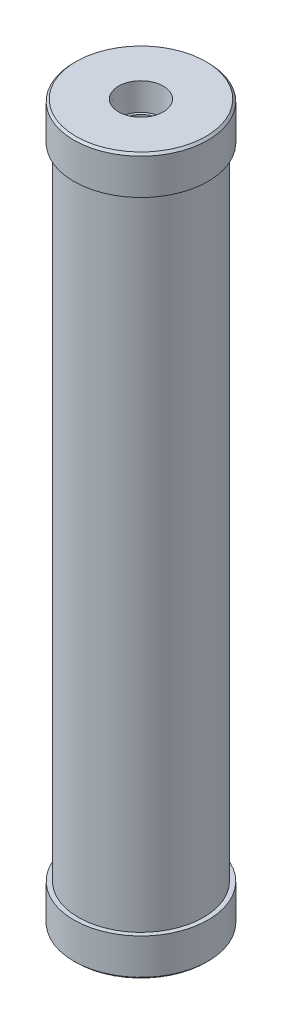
ISO-10303-21;
HEADER;
FILE_DESCRIPTION(('STEP AP214'),'2;1');
FILE_NAME('part.step','',(''),(''),'','','');
FILE_SCHEMA(('AUTOMOTIVE_DESIGN { 1 0 10303 214 1 1 1 1 }'));
ENDSEC;
DATA;
#1=APPLICATION_CONTEXT('core data for automotive mechanical design processes');
#2=APPLICATION_PROTOCOL_DEFINITION('international standard','automotive_design',2000,#1);
#3=PRODUCT_CONTEXT('',#1,'mechanical');
#4=PRODUCT('Part','Part','',(#3));
#5=PRODUCT_RELATED_PRODUCT_CATEGORY('part','',(#4));
#6=PRODUCT_DEFINITION_FORMATION('','',#4);
#7=PRODUCT_DEFINITION_CONTEXT('part definition',#1,'design');
#8=PRODUCT_DEFINITION('design','',#6,#7);
#9=PRODUCT_DEFINITION_SHAPE('','',#8);
#10=(LENGTH_UNIT() NAMED_UNIT(*) SI_UNIT(.MILLI.,.METRE.));
#11=(NAMED_UNIT(*) PLANE_ANGLE_UNIT() SI_UNIT($,.RADIAN.));
#12=(NAMED_UNIT(*) SI_UNIT($,.STERADIAN.) SOLID_ANGLE_UNIT());
#13=UNCERTAINTY_MEASURE_WITH_UNIT(LENGTH_MEASURE(1.E-05),#10,'distance_accuracy_value','');
#14=(GEOMETRIC_REPRESENTATION_CONTEXT(3) GLOBAL_UNCERTAINTY_ASSIGNED_CONTEXT((#13)) GLOBAL_UNIT_ASSIGNED_CONTEXT((#10,
#11,#12)) REPRESENTATION_CONTEXT('',''));
#15=CARTESIAN_POINT('',(0.,0.,0.));
#16=DIRECTION('',(0.,0.,1.));
#17=DIRECTION('',(1.,0.,0.));
#18=AXIS2_PLACEMENT_3D('',#15,#16,#17);
#19=CARTESIAN_POINT('',(0.,508.,0.));
#20=DIRECTION('',(0.,-1.,0.));
#21=DIRECTION('',(0.,0.,-1.));
#22=AXIS2_PLACEMENT_3D('',#19,#20,#21);
#23=CYLINDRICAL_SURFACE('',#22,44.45);
#24=CARTESIAN_POINT('',(0.,26.924,0.));
#25=DIRECTION('',(0.,1.,0.));
#26=DIRECTION('',(0.,0.,1.));
#27=AXIS2_PLACEMENT_3D('',#24,#25,#26);
#28=CIRCLE('',#27,44.45);
#29=CARTESIAN_POINT('',(0.,26.924,44.45));
#30=VERTEX_POINT('',#29);
#31=EDGE_CURVE('E71',#30,#30,#28,.T.);
#32=ORIENTED_EDGE('',*,*,#31,.T.);
#33=EDGE_LOOP('',(#32));
#34=FACE_BOUND('',#33,.T.);
#35=CARTESIAN_POINT('',(0.,481.076,0.));
#36=DIRECTION('',(0.,1.,0.));
#37=DIRECTION('',(0.,0.,1.));
#38=AXIS2_PLACEMENT_3D('',#35,#36,#37);
#39=CIRCLE('',#38,44.45);
#40=CARTESIAN_POINT('',(0.,481.076,44.45));
#41=VERTEX_POINT('',#40);
#42=EDGE_CURVE('E53',#41,#41,#39,.T.);
#43=ORIENTED_EDGE('',*,*,#42,.F.);
#44=EDGE_LOOP('',(#43));
#45=FACE_BOUND('',#44,.T.);
#46=ADVANCED_FACE('F33',(#34,#45),#23,.T.);
#47=CARTESIAN_POINT('',(0.,508.,0.));
#48=DIRECTION('',(0.,-1.,0.));
#49=DIRECTION('',(0.,0.,-1.));
#50=AXIS2_PLACEMENT_3D('',#47,#48,#49);
#51=CYLINDRICAL_SURFACE('',#50,38.6334);
#52=CARTESIAN_POINT('',(0.,26.924,0.));
#53=DIRECTION('',(0.,1.,0.));
#54=DIRECTION('',(0.,0.,1.));
#55=AXIS2_PLACEMENT_3D('',#52,#53,#54);
#56=CIRCLE('',#55,38.6334);
#57=CARTESIAN_POINT('',(0.,26.924,38.6334));
#58=VERTEX_POINT('',#57);
#59=EDGE_CURVE('E68',#58,#58,#56,.T.);
#60=ORIENTED_EDGE('',*,*,#59,.F.);
#61=EDGE_LOOP('',(#60));
#62=FACE_BOUND('',#61,.T.);
#63=CARTESIAN_POINT('',(0.,481.076,0.));
#64=DIRECTION('',(0.,1.,0.));
#65=DIRECTION('',(0.,0.,1.));
#66=AXIS2_PLACEMENT_3D('',#63,#64,#65);
#67=CIRCLE('',#66,38.6334);
#68=CARTESIAN_POINT('',(0.,481.076,38.6334));
#69=VERTEX_POINT('',#68);
#70=EDGE_CURVE('E59',#69,#69,#67,.T.);
#71=ORIENTED_EDGE('',*,*,#70,.T.);
#72=EDGE_LOOP('',(#71));
#73=FACE_BOUND('',#72,.T.);
#74=ADVANCED_FACE('F115',(#62,#73),#51,.F.);
#75=CARTESIAN_POINT('',(0.,26.924,0.));
#76=DIRECTION('',(0.,1.,0.));
#77=DIRECTION('',(0.,0.,1.));
#78=AXIS2_PLACEMENT_3D('',#75,#76,#77);
#79=PLANE('',#78);
#80=CARTESIAN_POINT('',(0.,26.924,0.));
#81=DIRECTION('',(0.,1.,0.));
#82=DIRECTION('',(0.,0.,1.));
#83=AXIS2_PLACEMENT_3D('',#80,#81,#82);
#84=CIRCLE('',#83,13.5);
#85=CARTESIAN_POINT('',(0.,26.924,13.5));
#86=VERTEX_POINT('',#85);
#87=EDGE_CURVE('E63',#86,#86,#84,.T.);
#88=ORIENTED_EDGE('',*,*,#87,.F.);
#89=EDGE_LOOP('',(#88));
#90=FACE_BOUND('',#89,.T.);
#91=ORIENTED_EDGE('',*,*,#59,.T.);
#92=EDGE_LOOP('',(#91));
#93=FACE_BOUND('',#92,.T.);
#94=ADVANCED_FACE('F121',(#90,#93),#79,.T.);
#95=CARTESIAN_POINT('',(0.,26.924,0.));
#96=DIRECTION('',(0.,1.,0.));
#97=DIRECTION('',(0.,0.,1.));
#98=AXIS2_PLACEMENT_3D('',#95,#96,#97);
#99=CIRCLE('',#98,47.625);
#100=CARTESIAN_POINT('',(0.,26.924,47.625));
#101=VERTEX_POINT('',#100);
#102=EDGE_CURVE('E66',#101,#101,#99,.T.);
#103=ORIENTED_EDGE('',*,*,#102,.T.);
#104=EDGE_LOOP('',(#103));
#105=FACE_BOUND('',#104,.T.);
#106=ORIENTED_EDGE('',*,*,#31,.F.);
#107=EDGE_LOOP('',(#106));
#108=FACE_BOUND('',#107,.T.);
#109=ADVANCED_FACE('F142',(#105,#108),#79,.T.);
#110=CARTESIAN_POINT('',(0.,26.924,0.));
#111=DIRECTION('',(0.,-1.,0.));
#112=DIRECTION('',(0.,0.,-1.));
#113=AXIS2_PLACEMENT_3D('',#110,#111,#112);
#114=CYLINDRICAL_SURFACE('',#113,47.625);
#115=CARTESIAN_POINT('',(0.,1.52400000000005,0.));
#116=DIRECTION('',(0.,1.,0.));
#117=DIRECTION('',(0.,0.,1.));
#118=AXIS2_PLACEMENT_3D('',#115,#116,#117);
#119=CIRCLE('',#118,47.625);
#120=CARTESIAN_POINT('',(0.,1.52400000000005,47.625));
#121=VERTEX_POINT('',#120);
#122=EDGE_CURVE('E48',#121,#121,#119,.T.);
#123=ORIENTED_EDGE('',*,*,#122,.T.);
#124=EDGE_LOOP('',(#123));
#125=FACE_BOUND('',#124,.T.);
#126=ORIENTED_EDGE('',*,*,#102,.F.);
#127=EDGE_LOOP('',(#126));
#128=FACE_BOUND('',#127,.T.);
#129=ADVANCED_FACE('F139',(#125,#128),#114,.T.);
#130=CARTESIAN_POINT('',(0.,0.,0.));
#131=DIRECTION('',(0.,1.,0.));
#132=DIRECTION('',(0.,0.,1.));
#133=AXIS2_PLACEMENT_3D('',#130,#131,#132);
#134=PLANE('',#133);
#135=CARTESIAN_POINT('',(0.,0.,0.));
#136=DIRECTION('',(0.,1.,0.));
#137=DIRECTION('',(0.,0.,1.));
#138=AXIS2_PLACEMENT_3D('',#135,#136,#137);
#139=CIRCLE('',#138,46.1009999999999);
#140=CARTESIAN_POINT('',(0.,0.,46.1009999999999));
#141=VERTEX_POINT('',#140);
#142=EDGE_CURVE('E44',#141,#141,#139,.F.);
#143=ORIENTED_EDGE('',*,*,#142,.T.);
#144=EDGE_LOOP('',(#143));
#145=FACE_BOUND('',#144,.T.);
#146=CARTESIAN_POINT('',(0.,0.,0.));
#147=DIRECTION('',(0.,-1.,0.));
#148=DIRECTION('',(0.,0.,-1.));
#149=AXIS2_PLACEMENT_3D('',#146,#147,#148);
#150=CIRCLE('',#149,15.886561);
#151=CARTESIAN_POINT('',(0.,0.,-15.886561));
#152=VERTEX_POINT('',#151);
#153=EDGE_CURVE('E62',#152,#152,#150,.T.);
#154=ORIENTED_EDGE('',*,*,#153,.F.);
#155=EDGE_LOOP('',(#154));
#156=FACE_BOUND('',#155,.T.);
#157=ADVANCED_FACE('F124',(#145,#156),#134,.F.);
#158=CARTESIAN_POINT('',(0.,0.,0.));
#159=DIRECTION('',(0.,-1.,0.));
#160=DIRECTION('',(0.,0.,-1.));
#161=AXIS2_PLACEMENT_3D('',#158,#159,#160);
#162=CYLINDRICAL_SURFACE('',#161,13.5);
#163=ORIENTED_EDGE('',*,*,#87,.T.);
#164=EDGE_LOOP('',(#163));
#165=FACE_BOUND('',#164,.T.);
#166=CARTESIAN_POINT('',(0.,19.05,0.));
#167=DIRECTION('',(0.,-1.,0.));
#168=DIRECTION('',(0.,0.,-1.));
#169=AXIS2_PLACEMENT_3D('',#166,#167,#168);
#170=CIRCLE('',#169,13.5);
#171=CARTESIAN_POINT('',(0.,19.05,-13.5));
#172=VERTEX_POINT('',#171);
#173=EDGE_CURVE('E67',#172,#172,#170,.T.);
#174=ORIENTED_EDGE('',*,*,#173,.T.);
#175=EDGE_LOOP('',(#174));
#176=FACE_BOUND('',#175,.T.);
#177=ADVANCED_FACE('F155',(#165,#176),#162,.F.);
#178=CARTESIAN_POINT('',(13.5,19.05,0.));
#179=DIRECTION('',(0.,1.,0.));
#180=DIRECTION('',(0.,0.,1.));
#181=AXIS2_PLACEMENT_3D('',#178,#179,#180);
#182=PLANE('',#181);
#183=ORIENTED_EDGE('',*,*,#173,.F.);
#184=EDGE_LOOP('',(#183));
#185=FACE_BOUND('',#184,.T.);
#186=CARTESIAN_POINT('',(0.,19.05,0.));
#187=DIRECTION('',(0.,-1.,0.));
#188=DIRECTION('',(0.,0.,-1.));
#189=AXIS2_PLACEMENT_3D('',#186,#187,#188);
#190=CIRCLE('',#189,15.2918843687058);
#191=CARTESIAN_POINT('',(0.,19.05,-15.2918843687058));
#192=VERTEX_POINT('',#191);
#193=EDGE_CURVE('E78',#192,#192,#190,.T.);
#194=ORIENTED_EDGE('',*,*,#193,.T.);
#195=EDGE_LOOP('',(#194));
#196=FACE_BOUND('',#195,.T.);
#197=ADVANCED_FACE('F158',(#185,#196),#182,.F.);
#198=CARTESIAN_POINT('',(0.,0.,0.));
#199=DIRECTION('',(0.,-1.,0.));
#200=DIRECTION('',(0.,0.,-1.));
#201=AXIS2_PLACEMENT_3D('',#198,#199,#200);
#202=CONICAL_SURFACE('',#201,15.886561,0.0312064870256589);
#203=ORIENTED_EDGE('',*,*,#193,.F.);
#204=EDGE_LOOP('',(#203));
#205=FACE_BOUND('',#204,.T.);
#206=ORIENTED_EDGE('',*,*,#153,.T.);
#207=EDGE_LOOP('',(#206));
#208=FACE_BOUND('',#207,.T.);
#209=ADVANCED_FACE('F162',(#205,#208),#202,.F.);
#210=CARTESIAN_POINT('',(0.,481.076,0.));
#211=DIRECTION('',(0.,1.,0.));
#212=DIRECTION('',(0.,0.,1.));
#213=AXIS2_PLACEMENT_3D('',#210,#211,#212);
#214=PLANE('',#213);
#215=CARTESIAN_POINT('',(0.,481.076,0.));
#216=DIRECTION('',(0.,1.,0.));
#217=DIRECTION('',(0.,0.,1.));
#218=AXIS2_PLACEMENT_3D('',#215,#216,#217);
#219=CIRCLE('',#218,13.5);
#220=CARTESIAN_POINT('',(0.,481.076,13.5));
#221=VERTEX_POINT('',#220);
#222=EDGE_CURVE('E54',#221,#221,#219,.T.);
#223=ORIENTED_EDGE('',*,*,#222,.T.);
#224=EDGE_LOOP('',(#223));
#225=FACE_BOUND('',#224,.T.);
#226=ORIENTED_EDGE('',*,*,#70,.F.);
#227=EDGE_LOOP('',(#226));
#228=FACE_BOUND('',#227,.T.);
#229=ADVANCED_FACE('F165',(#225,#228),#214,.F.);
#230=CARTESIAN_POINT('',(0.,481.076,0.));
#231=DIRECTION('',(0.,1.,0.));
#232=DIRECTION('',(0.,0.,1.));
#233=AXIS2_PLACEMENT_3D('',#230,#231,#232);
#234=CIRCLE('',#233,47.625);
#235=CARTESIAN_POINT('',(0.,481.076,47.625));
#236=VERTEX_POINT('',#235);
#237=EDGE_CURVE('E57',#236,#236,#234,.T.);
#238=ORIENTED_EDGE('',*,*,#237,.F.);
#239=EDGE_LOOP('',(#238));
#240=FACE_BOUND('',#239,.T.);
#241=ORIENTED_EDGE('',*,*,#42,.T.);
#242=EDGE_LOOP('',(#241));
#243=FACE_BOUND('',#242,.T.);
#244=ADVANCED_FACE('F110',(#240,#243),#214,.F.);
#245=CARTESIAN_POINT('',(0.,481.076,0.));
#246=DIRECTION('',(0.,1.,0.));
#247=DIRECTION('',(0.,0.,1.));
#248=AXIS2_PLACEMENT_3D('',#245,#246,#247);
#249=CYLINDRICAL_SURFACE('',#248,47.625);
#250=CARTESIAN_POINT('',(0.,506.476,0.));
#251=DIRECTION('',(0.,1.,0.));
#252=DIRECTION('',(0.,0.,1.));
#253=AXIS2_PLACEMENT_3D('',#250,#251,#252);
#254=CIRCLE('',#253,47.625);
#255=CARTESIAN_POINT('',(0.,506.476,47.625));
#256=VERTEX_POINT('',#255);
#257=EDGE_CURVE('E10',#256,#256,#254,.F.);
#258=ORIENTED_EDGE('',*,*,#257,.T.);
#259=EDGE_LOOP('',(#258));
#260=FACE_BOUND('',#259,.T.);
#261=ORIENTED_EDGE('',*,*,#237,.T.);
#262=EDGE_LOOP('',(#261));
#263=FACE_BOUND('',#262,.T.);
#264=ADVANCED_FACE('F101',(#260,#263),#249,.T.);
#265=CARTESIAN_POINT('',(0.,508.,0.));
#266=DIRECTION('',(0.,1.,0.));
#267=DIRECTION('',(0.,0.,1.));
#268=AXIS2_PLACEMENT_3D('',#265,#266,#267);
#269=PLANE('',#268);
#270=CARTESIAN_POINT('',(0.,508.,0.));
#271=DIRECTION('',(0.,1.,0.));
#272=DIRECTION('',(0.,0.,1.));
#273=AXIS2_PLACEMENT_3D('',#270,#271,#272);
#274=CIRCLE('',#273,46.1010000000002);
#275=CARTESIAN_POINT('',(0.,508.,46.1010000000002));
#276=VERTEX_POINT('',#275);
#277=EDGE_CURVE('E40',#276,#276,#274,.T.);
#278=ORIENTED_EDGE('',*,*,#277,.T.);
#279=EDGE_LOOP('',(#278));
#280=FACE_BOUND('',#279,.T.);
#281=CARTESIAN_POINT('',(0.,508.,0.));
#282=DIRECTION('',(0.,1.,0.));
#283=DIRECTION('',(0.,0.,1.));
#284=AXIS2_PLACEMENT_3D('',#281,#282,#283);
#285=CIRCLE('',#284,15.886561);
#286=CARTESIAN_POINT('',(0.,508.,15.886561));
#287=VERTEX_POINT('',#286);
#288=EDGE_CURVE('E92',#287,#287,#285,.T.);
#289=ORIENTED_EDGE('',*,*,#288,.F.);
#290=EDGE_LOOP('',(#289));
#291=FACE_BOUND('',#290,.T.);
#292=ADVANCED_FACE('F98',(#280,#291),#269,.T.);
#293=CARTESIAN_POINT('',(0.,508.,0.));
#294=DIRECTION('',(0.,1.,0.));
#295=DIRECTION('',(0.,0.,1.));
#296=AXIS2_PLACEMENT_3D('',#293,#294,#295);
#297=CYLINDRICAL_SURFACE('',#296,13.5);
#298=CARTESIAN_POINT('',(0.,488.95,0.));
#299=DIRECTION('',(0.,1.,0.));
#300=DIRECTION('',(0.,0.,1.));
#301=AXIS2_PLACEMENT_3D('',#298,#299,#300);
#302=CIRCLE('',#301,13.5);
#303=CARTESIAN_POINT('',(0.,488.95,13.5));
#304=VERTEX_POINT('',#303);
#305=EDGE_CURVE('E58',#304,#304,#302,.T.);
#306=ORIENTED_EDGE('',*,*,#305,.T.);
#307=EDGE_LOOP('',(#306));
#308=FACE_BOUND('',#307,.T.);
#309=ORIENTED_EDGE('',*,*,#222,.F.);
#310=EDGE_LOOP('',(#309));
#311=FACE_BOUND('',#310,.T.);
#312=ADVANCED_FACE('F100',(#308,#311),#297,.F.);
#313=CARTESIAN_POINT('',(13.5,488.95,0.));
#314=DIRECTION('',(0.,-1.,0.));
#315=DIRECTION('',(0.,0.,-1.));
#316=AXIS2_PLACEMENT_3D('',#313,#314,#315);
#317=PLANE('',#316);
#318=ORIENTED_EDGE('',*,*,#305,.F.);
#319=EDGE_LOOP('',(#318));
#320=FACE_BOUND('',#319,.T.);
#321=CARTESIAN_POINT('',(0.,488.95,0.));
#322=DIRECTION('',(0.,1.,0.));
#323=DIRECTION('',(0.,0.,1.));
#324=AXIS2_PLACEMENT_3D('',#321,#322,#323);
#325=CIRCLE('',#324,15.2918843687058);
#326=CARTESIAN_POINT('',(0.,488.95,15.2918843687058));
#327=VERTEX_POINT('',#326);
#328=EDGE_CURVE('E89',#327,#327,#325,.T.);
#329=ORIENTED_EDGE('',*,*,#328,.T.);
#330=EDGE_LOOP('',(#329));
#331=FACE_BOUND('',#330,.T.);
#332=ADVANCED_FACE('F107',(#320,#331),#317,.F.);
#333=CARTESIAN_POINT('',(0.,508.,0.));
#334=DIRECTION('',(0.,1.,0.));
#335=DIRECTION('',(0.,0.,1.));
#336=AXIS2_PLACEMENT_3D('',#333,#334,#335);
#337=CONICAL_SURFACE('',#336,15.886561,0.0312064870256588);
#338=ORIENTED_EDGE('',*,*,#328,.F.);
#339=EDGE_LOOP('',(#338));
#340=FACE_BOUND('',#339,.T.);
#341=ORIENTED_EDGE('',*,*,#288,.T.);
#342=EDGE_LOOP('',(#341));
#343=FACE_BOUND('',#342,.T.);
#344=ADVANCED_FACE('F96',(#340,#343),#337,.F.);
#345=CARTESIAN_POINT('',(0.,1.52400000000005,0.));
#346=DIRECTION('',(0.,1.,0.));
#347=DIRECTION('',(0.,0.,1.));
#348=AXIS2_PLACEMENT_3D('',#345,#346,#347);
#349=CONICAL_SURFACE('',#348,47.625,0.785398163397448);
#350=ORIENTED_EDGE('',*,*,#142,.F.);
#351=EDGE_LOOP('',(#350));
#352=FACE_BOUND('',#351,.T.);
#353=ORIENTED_EDGE('',*,*,#122,.F.);
#354=EDGE_LOOP('',(#353));
#355=FACE_BOUND('',#354,.T.);
#356=ADVANCED_FACE('F125',(#352,#355),#349,.T.);
#357=CARTESIAN_POINT('',(0.,508.,0.));
#358=DIRECTION('',(0.,-1.,0.));
#359=DIRECTION('',(0.,0.,-1.));
#360=AXIS2_PLACEMENT_3D('',#357,#358,#359);
#361=CONICAL_SURFACE('',#360,46.1010000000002,0.785398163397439);
#362=ORIENTED_EDGE('',*,*,#257,.F.);
#363=EDGE_LOOP('',(#362));
#364=FACE_BOUND('',#363,.T.);
#365=ORIENTED_EDGE('',*,*,#277,.F.);
#366=EDGE_LOOP('',(#365));
#367=FACE_BOUND('',#366,.T.);
#368=ADVANCED_FACE('F35',(#364,#367),#361,.T.);
#369=CLOSED_SHELL('',(#46,#74,#94,#109,#129,#157,#177,#197,#209,#229,#244,#264,#292,#312,#332,
#344,#356,#368));
#370=MANIFOLD_SOLID_BREP('B2',#369);
#371=ADVANCED_BREP_SHAPE_REPRESENTATION('',(#18,#370),#14);
#372=SHAPE_DEFINITION_REPRESENTATION(#9,#371);
ENDSEC;
END-ISO-10303-21;
